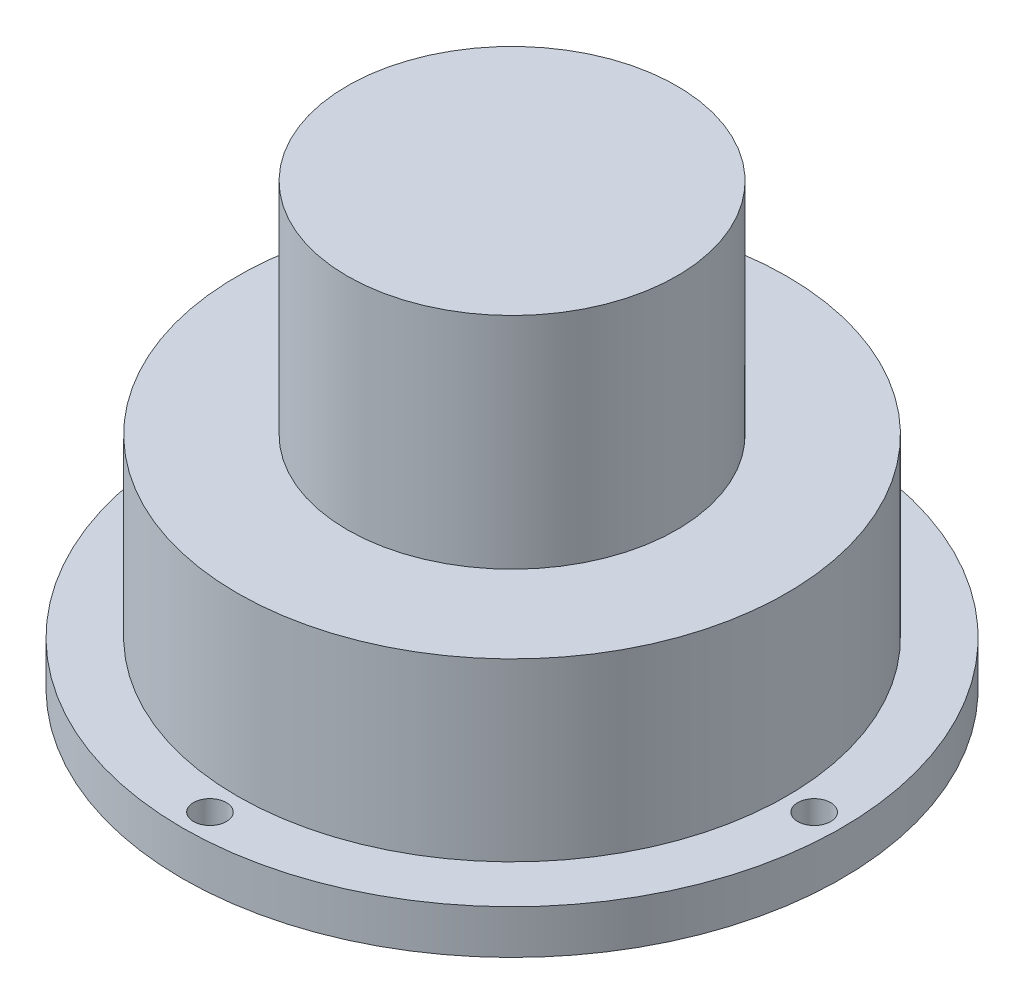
ISO-10303-21;
HEADER;
FILE_DESCRIPTION(('STEP AP214'),'2;1');
FILE_NAME('part.step','',(''),(''),'','','');
FILE_SCHEMA(('AUTOMOTIVE_DESIGN { 1 0 10303 214 1 1 1 1 }'));
ENDSEC;
DATA;
#1=APPLICATION_CONTEXT('core data for automotive mechanical design processes');
#2=APPLICATION_PROTOCOL_DEFINITION('international standard','automotive_design',2000,#1);
#3=PRODUCT_CONTEXT('',#1,'mechanical');
#4=PRODUCT('Part','Part','',(#3));
#5=PRODUCT_RELATED_PRODUCT_CATEGORY('part','',(#4));
#6=PRODUCT_DEFINITION_FORMATION('','',#4);
#7=PRODUCT_DEFINITION_CONTEXT('part definition',#1,'design');
#8=PRODUCT_DEFINITION('design','',#6,#7);
#9=PRODUCT_DEFINITION_SHAPE('','',#8);
#10=(LENGTH_UNIT() NAMED_UNIT(*) SI_UNIT(.MILLI.,.METRE.));
#11=(NAMED_UNIT(*) PLANE_ANGLE_UNIT() SI_UNIT($,.RADIAN.));
#12=(NAMED_UNIT(*) SI_UNIT($,.STERADIAN.) SOLID_ANGLE_UNIT());
#13=UNCERTAINTY_MEASURE_WITH_UNIT(LENGTH_MEASURE(1.E-05),#10,'distance_accuracy_value','');
#14=(GEOMETRIC_REPRESENTATION_CONTEXT(3) GLOBAL_UNCERTAINTY_ASSIGNED_CONTEXT((#13)) GLOBAL_UNIT_ASSIGNED_CONTEXT((#10,
#11,#12)) REPRESENTATION_CONTEXT('',''));
#15=CARTESIAN_POINT('',(0.,0.,0.));
#16=DIRECTION('',(0.,0.,1.));
#17=DIRECTION('',(1.,0.,0.));
#18=AXIS2_PLACEMENT_3D('',#15,#16,#17);
#19=CARTESIAN_POINT('',(0.,46.2776793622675,0.));
#20=DIRECTION('',(0.,1.,0.));
#21=DIRECTION('',(0.,0.,1.));
#22=AXIS2_PLACEMENT_3D('',#19,#20,#21);
#23=PLANE('',#22);
#24=CARTESIAN_POINT('',(7.19878790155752E-13,46.2776793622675,-68.75));
#25=DIRECTION('',(0.,1.,0.));
#26=DIRECTION('',(0.,0.,1.));
#27=AXIS2_PLACEMENT_3D('',#24,#25,#26);
#28=CIRCLE('',#27,3.75);
#29=CARTESIAN_POINT('',(7.19878790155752E-13,46.2776793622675,-65.));
#30=VERTEX_POINT('',#29);
#31=EDGE_CURVE('E118',#30,#30,#28,.T.);
#32=ORIENTED_EDGE('',*,*,#31,.F.);
#33=EDGE_LOOP('',(#32));
#34=FACE_BOUND('',#33,.T.);
#35=CARTESIAN_POINT('',(-68.75,46.2776793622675,0.));
#36=DIRECTION('',(0.,1.,0.));
#37=DIRECTION('',(0.,0.,1.));
#38=AXIS2_PLACEMENT_3D('',#35,#36,#37);
#39=CIRCLE('',#38,3.75);
#40=CARTESIAN_POINT('',(-68.75,46.2776793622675,3.75000000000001));
#41=VERTEX_POINT('',#40);
#42=EDGE_CURVE('E120',#41,#41,#39,.T.);
#43=ORIENTED_EDGE('',*,*,#42,.F.);
#44=EDGE_LOOP('',(#43));
#45=FACE_BOUND('',#44,.T.);
#46=CARTESIAN_POINT('',(-2.40278578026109E-13,46.2776793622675,68.75));
#47=DIRECTION('',(0.,1.,0.));
#48=DIRECTION('',(0.,0.,1.));
#49=AXIS2_PLACEMENT_3D('',#46,#47,#48);
#50=CIRCLE('',#49,3.75);
#51=CARTESIAN_POINT('',(-2.40278578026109E-13,46.2776793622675,72.5));
#52=VERTEX_POINT('',#51);
#53=EDGE_CURVE('E128',#52,#52,#50,.T.);
#54=ORIENTED_EDGE('',*,*,#53,.F.);
#55=EDGE_LOOP('',(#54));
#56=FACE_BOUND('',#55,.T.);
#57=CARTESIAN_POINT('',(68.75,46.2776793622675,0.));
#58=DIRECTION('',(0.,1.,0.));
#59=DIRECTION('',(0.,0.,1.));
#60=AXIS2_PLACEMENT_3D('',#57,#58,#59);
#61=CIRCLE('',#60,3.75);
#62=CARTESIAN_POINT('',(68.75,46.2776793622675,3.75000000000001));
#63=VERTEX_POINT('',#62);
#64=EDGE_CURVE('E134',#63,#63,#61,.T.);
#65=ORIENTED_EDGE('',*,*,#64,.F.);
#66=EDGE_LOOP('',(#65));
#67=FACE_BOUND('',#66,.T.);
#68=CARTESIAN_POINT('',(0.,46.2776793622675,0.));
#69=DIRECTION('',(0.,1.,0.));
#70=DIRECTION('',(0.,0.,1.));
#71=AXIS2_PLACEMENT_3D('',#68,#69,#70);
#72=CIRCLE('',#71,75.);
#73=CARTESIAN_POINT('',(0.,46.2776793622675,75.));
#74=VERTEX_POINT('',#73);
#75=EDGE_CURVE('E48',#74,#74,#72,.T.);
#76=ORIENTED_EDGE('',*,*,#75,.T.);
#77=EDGE_LOOP('',(#76));
#78=FACE_BOUND('',#77,.T.);
#79=CARTESIAN_POINT('',(0.,46.2776793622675,0.));
#80=DIRECTION('',(0.,1.,0.));
#81=DIRECTION('',(0.,0.,1.));
#82=AXIS2_PLACEMENT_3D('',#79,#80,#81);
#83=CIRCLE('',#82,62.5);
#84=CARTESIAN_POINT('',(0.,46.2776793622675,62.5));
#85=VERTEX_POINT('',#84);
#86=EDGE_CURVE('E60',#85,#85,#83,.T.);
#87=ORIENTED_EDGE('',*,*,#86,.F.);
#88=EDGE_LOOP('',(#87));
#89=FACE_BOUND('',#88,.T.);
#90=ADVANCED_FACE('F40',(#34,#45,#56,#67,#78,#89),#23,.T.);
#91=CARTESIAN_POINT('',(0.,36.2776793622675,0.));
#92=DIRECTION('',(0.,1.,0.));
#93=DIRECTION('',(0.,0.,1.));
#94=AXIS2_PLACEMENT_3D('',#91,#92,#93);
#95=PLANE('',#94);
#96=CARTESIAN_POINT('',(7.19878790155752E-13,36.2776793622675,-68.75));
#97=DIRECTION('',(0.,1.,0.));
#98=DIRECTION('',(0.,0.,1.));
#99=AXIS2_PLACEMENT_3D('',#96,#97,#98);
#100=CIRCLE('',#99,3.75);
#101=CARTESIAN_POINT('',(7.19878790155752E-13,36.2776793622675,-65.));
#102=VERTEX_POINT('',#101);
#103=EDGE_CURVE('E115',#102,#102,#100,.T.);
#104=ORIENTED_EDGE('',*,*,#103,.T.);
#105=EDGE_LOOP('',(#104));
#106=FACE_BOUND('',#105,.T.);
#107=CARTESIAN_POINT('',(-68.75,36.2776793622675,0.));
#108=DIRECTION('',(0.,1.,0.));
#109=DIRECTION('',(0.,0.,1.));
#110=AXIS2_PLACEMENT_3D('',#107,#108,#109);
#111=CIRCLE('',#110,3.75);
#112=CARTESIAN_POINT('',(-68.75,36.2776793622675,3.75000000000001));
#113=VERTEX_POINT('',#112);
#114=EDGE_CURVE('E125',#113,#113,#111,.T.);
#115=ORIENTED_EDGE('',*,*,#114,.T.);
#116=EDGE_LOOP('',(#115));
#117=FACE_BOUND('',#116,.T.);
#118=CARTESIAN_POINT('',(-2.40278578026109E-13,36.2776793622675,68.75));
#119=DIRECTION('',(0.,1.,0.));
#120=DIRECTION('',(0.,0.,1.));
#121=AXIS2_PLACEMENT_3D('',#118,#119,#120);
#122=CIRCLE('',#121,3.75);
#123=CARTESIAN_POINT('',(-2.40278578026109E-13,36.2776793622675,72.5));
#124=VERTEX_POINT('',#123);
#125=EDGE_CURVE('E131',#124,#124,#122,.T.);
#126=ORIENTED_EDGE('',*,*,#125,.T.);
#127=EDGE_LOOP('',(#126));
#128=FACE_BOUND('',#127,.T.);
#129=CARTESIAN_POINT('',(68.75,36.2776793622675,0.));
#130=DIRECTION('',(0.,1.,0.));
#131=DIRECTION('',(0.,0.,1.));
#132=AXIS2_PLACEMENT_3D('',#129,#130,#131);
#133=CIRCLE('',#132,3.75);
#134=CARTESIAN_POINT('',(68.75,36.2776793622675,3.75000000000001));
#135=VERTEX_POINT('',#134);
#136=EDGE_CURVE('E136',#135,#135,#133,.T.);
#137=ORIENTED_EDGE('',*,*,#136,.T.);
#138=EDGE_LOOP('',(#137));
#139=FACE_BOUND('',#138,.T.);
#140=CARTESIAN_POINT('',(0.,36.2776793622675,0.));
#141=DIRECTION('',(0.,1.,0.));
#142=DIRECTION('',(0.,0.,1.));
#143=AXIS2_PLACEMENT_3D('',#140,#141,#142);
#144=CIRCLE('',#143,75.);
#145=CARTESIAN_POINT('',(0.,36.2776793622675,75.));
#146=VERTEX_POINT('',#145);
#147=EDGE_CURVE('E44',#146,#146,#144,.T.);
#148=ORIENTED_EDGE('',*,*,#147,.F.);
#149=EDGE_LOOP('',(#148));
#150=FACE_BOUND('',#149,.T.);
#151=ADVANCED_FACE('F68',(#106,#117,#128,#139,#150),#95,.F.);
#152=CARTESIAN_POINT('',(0.,46.2776793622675,0.));
#153=DIRECTION('',(0.,-1.,0.));
#154=DIRECTION('',(0.,0.,-1.));
#155=AXIS2_PLACEMENT_3D('',#152,#153,#154);
#156=CYLINDRICAL_SURFACE('',#155,75.);
#157=ORIENTED_EDGE('',*,*,#75,.F.);
#158=EDGE_LOOP('',(#157));
#159=FACE_BOUND('',#158,.T.);
#160=ORIENTED_EDGE('',*,*,#147,.T.);
#161=EDGE_LOOP('',(#160));
#162=FACE_BOUND('',#161,.T.);
#163=ADVANCED_FACE('F42',(#159,#162),#156,.T.);
#164=CARTESIAN_POINT('',(0.,86.2776793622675,0.));
#165=DIRECTION('',(0.,-1.,0.));
#166=DIRECTION('',(0.,0.,-1.));
#167=AXIS2_PLACEMENT_3D('',#164,#165,#166);
#168=CYLINDRICAL_SURFACE('',#167,62.5);
#169=ORIENTED_EDGE('',*,*,#86,.T.);
#170=EDGE_LOOP('',(#169));
#171=FACE_BOUND('',#170,.T.);
#172=CARTESIAN_POINT('',(0.,86.2776793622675,0.));
#173=DIRECTION('',(0.,1.,0.));
#174=DIRECTION('',(0.,0.,1.));
#175=AXIS2_PLACEMENT_3D('',#172,#173,#174);
#176=CIRCLE('',#175,62.5);
#177=CARTESIAN_POINT('',(0.,86.2776793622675,62.5));
#178=VERTEX_POINT('',#177);
#179=EDGE_CURVE('E57',#178,#178,#176,.T.);
#180=ORIENTED_EDGE('',*,*,#179,.F.);
#181=EDGE_LOOP('',(#180));
#182=FACE_BOUND('',#181,.T.);
#183=ADVANCED_FACE('F75',(#171,#182),#168,.T.);
#184=CARTESIAN_POINT('',(0.,86.2776793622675,0.));
#185=DIRECTION('',(0.,1.,0.));
#186=DIRECTION('',(0.,0.,1.));
#187=AXIS2_PLACEMENT_3D('',#184,#185,#186);
#188=PLANE('',#187);
#189=CARTESIAN_POINT('',(0.,86.2776793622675,0.));
#190=DIRECTION('',(0.,1.,0.));
#191=DIRECTION('',(0.,0.,1.));
#192=AXIS2_PLACEMENT_3D('',#189,#190,#191);
#193=CIRCLE('',#192,37.5);
#194=CARTESIAN_POINT('',(0.,86.2776793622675,37.5));
#195=VERTEX_POINT('',#194);
#196=EDGE_CURVE('E11',#195,#195,#193,.T.);
#197=ORIENTED_EDGE('',*,*,#196,.F.);
#198=EDGE_LOOP('',(#197));
#199=FACE_BOUND('',#198,.T.);
#200=ORIENTED_EDGE('',*,*,#179,.T.);
#201=EDGE_LOOP('',(#200));
#202=FACE_BOUND('',#201,.T.);
#203=ADVANCED_FACE('F84',(#199,#202),#188,.T.);
#204=CARTESIAN_POINT('',(0.,136.277679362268,0.));
#205=DIRECTION('',(0.,-1.,0.));
#206=DIRECTION('',(0.,0.,-1.));
#207=AXIS2_PLACEMENT_3D('',#204,#205,#206);
#208=CYLINDRICAL_SURFACE('',#207,37.5);
#209=CARTESIAN_POINT('',(0.,136.277679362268,0.));
#210=DIRECTION('',(0.,1.,0.));
#211=DIRECTION('',(0.,0.,1.));
#212=AXIS2_PLACEMENT_3D('',#209,#210,#211);
#213=CIRCLE('',#212,37.5);
#214=CARTESIAN_POINT('',(0.,136.277679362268,37.5));
#215=VERTEX_POINT('',#214);
#216=EDGE_CURVE('E55',#215,#215,#213,.T.);
#217=ORIENTED_EDGE('',*,*,#216,.F.);
#218=EDGE_LOOP('',(#217));
#219=FACE_BOUND('',#218,.T.);
#220=ORIENTED_EDGE('',*,*,#196,.T.);
#221=EDGE_LOOP('',(#220));
#222=FACE_BOUND('',#221,.T.);
#223=ADVANCED_FACE('F87',(#219,#222),#208,.T.);
#224=CARTESIAN_POINT('',(0.,136.277679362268,0.));
#225=DIRECTION('',(0.,1.,0.));
#226=DIRECTION('',(0.,0.,1.));
#227=AXIS2_PLACEMENT_3D('',#224,#225,#226);
#228=PLANE('',#227);
#229=ORIENTED_EDGE('',*,*,#216,.T.);
#230=EDGE_LOOP('',(#229));
#231=FACE_BOUND('',#230,.T.);
#232=ADVANCED_FACE('F91',(#231),#228,.T.);
#233=CARTESIAN_POINT('',(68.75,46.2776793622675,0.));
#234=DIRECTION('',(0.,1.,0.));
#235=DIRECTION('',(0.,0.,1.));
#236=AXIS2_PLACEMENT_3D('',#233,#234,#235);
#237=CYLINDRICAL_SURFACE('',#236,3.75);
#238=ORIENTED_EDGE('',*,*,#136,.F.);
#239=EDGE_LOOP('',(#238));
#240=FACE_BOUND('',#239,.T.);
#241=ORIENTED_EDGE('',*,*,#64,.T.);
#242=EDGE_LOOP('',(#241));
#243=FACE_BOUND('',#242,.T.);
#244=ADVANCED_FACE('F95',(#240,#243),#237,.F.);
#245=CARTESIAN_POINT('',(-2.40278578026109E-13,46.2776793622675,68.75));
#246=DIRECTION('',(0.,1.,0.));
#247=DIRECTION('',(0.,0.,1.));
#248=AXIS2_PLACEMENT_3D('',#245,#246,#247);
#249=CYLINDRICAL_SURFACE('',#248,3.75);
#250=ORIENTED_EDGE('',*,*,#125,.F.);
#251=EDGE_LOOP('',(#250));
#252=FACE_BOUND('',#251,.T.);
#253=ORIENTED_EDGE('',*,*,#53,.T.);
#254=EDGE_LOOP('',(#253));
#255=FACE_BOUND('',#254,.T.);
#256=ADVANCED_FACE('F99',(#252,#255),#249,.F.);
#257=CARTESIAN_POINT('',(-68.75,46.2776793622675,0.));
#258=DIRECTION('',(0.,1.,0.));
#259=DIRECTION('',(0.,0.,1.));
#260=AXIS2_PLACEMENT_3D('',#257,#258,#259);
#261=CYLINDRICAL_SURFACE('',#260,3.75);
#262=ORIENTED_EDGE('',*,*,#114,.F.);
#263=EDGE_LOOP('',(#262));
#264=FACE_BOUND('',#263,.T.);
#265=ORIENTED_EDGE('',*,*,#42,.T.);
#266=EDGE_LOOP('',(#265));
#267=FACE_BOUND('',#266,.T.);
#268=ADVANCED_FACE('F103',(#264,#267),#261,.F.);
#269=CARTESIAN_POINT('',(7.19878790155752E-13,46.2776793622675,-68.75));
#270=DIRECTION('',(0.,1.,0.));
#271=DIRECTION('',(0.,0.,1.));
#272=AXIS2_PLACEMENT_3D('',#269,#270,#271);
#273=CYLINDRICAL_SURFACE('',#272,3.75);
#274=ORIENTED_EDGE('',*,*,#103,.F.);
#275=EDGE_LOOP('',(#274));
#276=FACE_BOUND('',#275,.T.);
#277=ORIENTED_EDGE('',*,*,#31,.T.);
#278=EDGE_LOOP('',(#277));
#279=FACE_BOUND('',#278,.T.);
#280=ADVANCED_FACE('F107',(#276,#279),#273,.F.);
#281=CLOSED_SHELL('',(#90,#151,#163,#183,#203,#223,#232,#244,#256,#268,#280));
#282=MANIFOLD_SOLID_BREP('B2',#281);
#283=ADVANCED_BREP_SHAPE_REPRESENTATION('',(#18,#282),#14);
#284=SHAPE_DEFINITION_REPRESENTATION(#9,#283);
ENDSEC;
END-ISO-10303-21;
